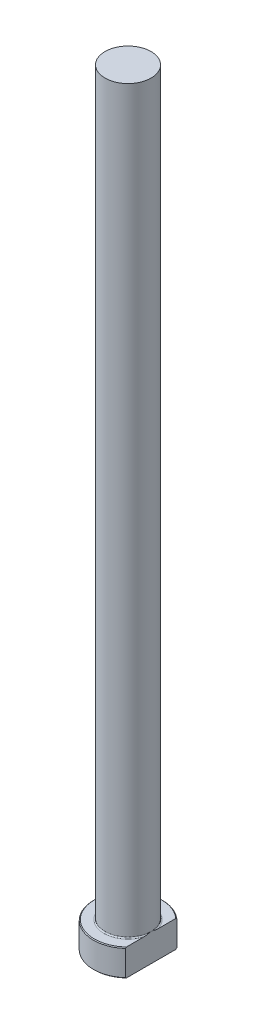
ISO-10303-21;
HEADER;
FILE_DESCRIPTION(('STEP AP214'),'2;1');
FILE_NAME('part.step','',(''),(''),'','','');
FILE_SCHEMA(('AUTOMOTIVE_DESIGN { 1 0 10303 214 1 1 1 1 }'));
ENDSEC;
DATA;
#1=APPLICATION_CONTEXT('core data for automotive mechanical design processes');
#2=APPLICATION_PROTOCOL_DEFINITION('international standard','automotive_design',2000,#1);
#3=PRODUCT_CONTEXT('',#1,'mechanical');
#4=PRODUCT('Part','Part','',(#3));
#5=PRODUCT_RELATED_PRODUCT_CATEGORY('part','',(#4));
#6=PRODUCT_DEFINITION_FORMATION('','',#4);
#7=PRODUCT_DEFINITION_CONTEXT('part definition',#1,'design');
#8=PRODUCT_DEFINITION('design','',#6,#7);
#9=PRODUCT_DEFINITION_SHAPE('','',#8);
#10=(LENGTH_UNIT() NAMED_UNIT(*) SI_UNIT(.MILLI.,.METRE.));
#11=(NAMED_UNIT(*) PLANE_ANGLE_UNIT() SI_UNIT($,.RADIAN.));
#12=(NAMED_UNIT(*) SI_UNIT($,.STERADIAN.) SOLID_ANGLE_UNIT());
#13=UNCERTAINTY_MEASURE_WITH_UNIT(LENGTH_MEASURE(1.E-05),#10,'distance_accuracy_value','');
#14=(GEOMETRIC_REPRESENTATION_CONTEXT(3) GLOBAL_UNCERTAINTY_ASSIGNED_CONTEXT((#13)) GLOBAL_UNIT_ASSIGNED_CONTEXT((#10,
#11,#12)) REPRESENTATION_CONTEXT('',''));
#15=CARTESIAN_POINT('',(0.,0.,0.));
#16=DIRECTION('',(0.,0.,1.));
#17=DIRECTION('',(1.,0.,0.));
#18=AXIS2_PLACEMENT_3D('',#15,#16,#17);
#19=CARTESIAN_POINT('',(0.,0.,0.));
#20=DIRECTION('',(0.,-1.,0.));
#21=DIRECTION('',(0.,0.,-1.));
#22=AXIS2_PLACEMENT_3D('',#19,#20,#21);
#23=PLANE('',#22);
#24=CARTESIAN_POINT('',(0.,0.,0.));
#25=DIRECTION('',(0.,-1.,0.));
#26=DIRECTION('',(0.,0.,-1.));
#27=AXIS2_PLACEMENT_3D('',#24,#25,#26);
#28=CIRCLE('',#27,8.79999999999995);
#29=CARTESIAN_POINT('',(5.99999999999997,0.,6.43739077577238));
#30=VERTEX_POINT('',#29);
#31=CARTESIAN_POINT('',(5.99999999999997,0.,-6.43739077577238));
#32=VERTEX_POINT('',#31);
#33=EDGE_CURVE('E98',#30,#32,#28,.T.);
#34=ORIENTED_EDGE('',*,*,#33,.T.);
#35=DIRECTION('',(0.,0.,1.));
#36=VECTOR('',#35,1.);
#37=CARTESIAN_POINT('',(5.99999999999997,0.,-6.70820393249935));
#38=LINE('',#37,#36);
#39=EDGE_CURVE('E83',#32,#30,#38,.T.);
#40=ORIENTED_EDGE('',*,*,#39,.T.);
#41=EDGE_LOOP('',(#34,#40));
#42=FACE_BOUND('',#41,.T.);
#43=ADVANCED_FACE('F32',(#42),#23,.T.);
#44=CARTESIAN_POINT('',(0.,259.958771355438,0.));
#45=DIRECTION('',(0.,1.,0.));
#46=DIRECTION('',(0.,0.,1.));
#47=AXIS2_PLACEMENT_3D('',#44,#45,#46);
#48=CYLINDRICAL_SURFACE('',#47,8.99999999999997);
#49=CARTESIAN_POINT('',(0.,6.80000000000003,0.));
#50=DIRECTION('',(0.,1.,0.));
#51=DIRECTION('',(0.,0.,1.));
#52=AXIS2_PLACEMENT_3D('',#49,#50,#51);
#53=CIRCLE('',#52,8.99999999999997);
#54=CARTESIAN_POINT('',(5.99999999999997,6.80000000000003,6.70820393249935));
#55=VERTEX_POINT('',#54);
#56=CARTESIAN_POINT('',(5.99999999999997,6.80000000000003,-6.70820393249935));
#57=VERTEX_POINT('',#56);
#58=EDGE_CURVE('E104',#55,#57,#53,.F.);
#59=ORIENTED_EDGE('',*,*,#58,.T.);
#60=DIRECTION('',(0.,-1.,0.));
#61=VECTOR('',#60,1.);
#62=CARTESIAN_POINT('',(5.99999999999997,200.,-6.70820393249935));
#63=LINE('',#62,#61);
#64=CARTESIAN_POINT('',(5.99999999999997,0.200000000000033,-6.70820393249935));
#65=VERTEX_POINT('',#64);
#66=EDGE_CURVE('E183',#57,#65,#63,.T.);
#67=ORIENTED_EDGE('',*,*,#66,.T.);
#68=CARTESIAN_POINT('',(0.,0.200000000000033,0.));
#69=DIRECTION('',(0.,-1.,0.));
#70=DIRECTION('',(0.,0.,-1.));
#71=AXIS2_PLACEMENT_3D('',#68,#69,#70);
#72=CIRCLE('',#71,8.99999999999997);
#73=CARTESIAN_POINT('',(5.99999999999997,0.200000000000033,6.70820393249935));
#74=VERTEX_POINT('',#73);
#75=EDGE_CURVE('E100',#65,#74,#72,.F.);
#76=ORIENTED_EDGE('',*,*,#75,.T.);
#77=DIRECTION('',(0.,-1.,0.));
#78=VECTOR('',#77,1.);
#79=CARTESIAN_POINT('',(5.99999999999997,200.,6.70820393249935));
#80=LINE('',#79,#78);
#81=EDGE_CURVE('E93',#55,#74,#80,.T.);
#82=ORIENTED_EDGE('',*,*,#81,.F.);
#83=EDGE_LOOP('',(#59,#67,#76,#82));
#84=FACE_BOUND('',#83,.T.);
#85=ADVANCED_FACE('F158',(#84),#48,.T.);
#86=CARTESIAN_POINT('',(-8.99999999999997,7.,0.));
#87=DIRECTION('',(0.,1.,0.));
#88=DIRECTION('',(0.,0.,1.));
#89=AXIS2_PLACEMENT_3D('',#86,#87,#88);
#90=PLANE('',#89);
#91=CARTESIAN_POINT('',(0.,7.,0.));
#92=DIRECTION('',(0.,1.,0.));
#93=DIRECTION('',(0.,0.,1.));
#94=AXIS2_PLACEMENT_3D('',#91,#92,#93);
#95=CIRCLE('',#94,8.79999999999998);
#96=CARTESIAN_POINT('',(5.99999999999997,7.,-6.43739077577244));
#97=VERTEX_POINT('',#96);
#98=CARTESIAN_POINT('',(5.99999999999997,7.,6.43739077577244));
#99=VERTEX_POINT('',#98);
#100=EDGE_CURVE('E178',#97,#99,#95,.T.);
#101=ORIENTED_EDGE('',*,*,#100,.T.);
#102=DIRECTION('',(0.,0.,-1.));
#103=VECTOR('',#102,1.);
#104=CARTESIAN_POINT('',(5.99999999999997,7.,0.));
#105=LINE('',#104,#103);
#106=CARTESIAN_POINT('',(5.99999999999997,6.99999999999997,1.92093727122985));
#107=VERTEX_POINT('',#106);
#108=EDGE_CURVE('E57',#99,#107,#105,.T.);
#109=ORIENTED_EDGE('',*,*,#108,.T.);
#110=CARTESIAN_POINT('',(0.,7.,0.));
#111=DIRECTION('',(0.,1.,0.));
#112=DIRECTION('',(0.,0.,1.));
#113=AXIS2_PLACEMENT_3D('',#110,#111,#112);
#114=CIRCLE('',#113,6.29999999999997);
#115=CARTESIAN_POINT('',(5.99999999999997,6.99999999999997,-1.92093727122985));
#116=VERTEX_POINT('',#115);
#117=EDGE_CURVE('E107',#107,#116,#114,.F.);
#118=ORIENTED_EDGE('',*,*,#117,.T.);
#119=EDGE_CURVE('E136',#116,#97,#105,.T.);
#120=ORIENTED_EDGE('',*,*,#119,.T.);
#121=EDGE_LOOP('',(#101,#109,#118,#120));
#122=FACE_BOUND('',#121,.T.);
#123=ADVANCED_FACE('F147',(#122),#90,.T.);
#124=CARTESIAN_POINT('',(0.,7.00000000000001,0.));
#125=DIRECTION('',(0.,-1.,0.));
#126=DIRECTION('',(0.,0.,-1.));
#127=AXIS2_PLACEMENT_3D('',#124,#125,#126);
#128=CONICAL_SURFACE('',#127,8.79999999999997,0.785398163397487);
#129=ORIENTED_EDGE('',*,*,#58,.F.);
#130=CARTESIAN_POINT('',(5.99999999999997,-0.132115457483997,14.7591430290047));
#131=CARTESIAN_POINT('',(5.99999999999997,0.0733919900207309,14.537299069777));
#132=CARTESIAN_POINT('',(5.99999999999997,0.278550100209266,14.3151315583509));
#133=CARTESIAN_POINT('',(5.99999999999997,0.688060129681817,13.8700519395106));
#134=CARTESIAN_POINT('',(5.99999999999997,0.892412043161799,13.647139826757));
#135=CARTESIAN_POINT('',(5.99999999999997,1.50418032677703,12.9770492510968));
#136=CARTESIAN_POINT('',(5.99999999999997,1.91022091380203,12.5286117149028));
#137=CARTESIAN_POINT('',(5.99999999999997,2.71980134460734,11.6246427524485));
#138=CARTESIAN_POINT('',(5.99999999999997,3.12331180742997,11.1690849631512));
#139=CARTESIAN_POINT('',(5.99999999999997,3.92341525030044,10.2520077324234));
#140=CARTESIAN_POINT('',(5.99999999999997,4.32000903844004,9.79048899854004));
#141=CARTESIAN_POINT('',(5.99999999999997,5.02478816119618,8.95241885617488));
#142=CARTESIAN_POINT('',(5.99999999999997,5.33476112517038,8.57737771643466));
#143=CARTESIAN_POINT('',(5.99999999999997,5.79310598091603,8.00939108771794));
#144=CARTESIAN_POINT('',(5.99999999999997,5.94480562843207,7.81913145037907));
#145=CARTESIAN_POINT('',(5.99999999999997,6.24553651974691,7.43651727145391));
#146=CARTESIAN_POINT('',(5.99999999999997,6.39456781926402,7.24416277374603));
#147=CARTESIAN_POINT('',(5.99999999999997,6.68925367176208,6.8572154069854));
#148=CARTESIAN_POINT('',(5.99999999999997,6.83491177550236,6.66262524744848));
#149=CARTESIAN_POINT('',(5.99999999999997,7.122307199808,6.27057707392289));
#150=CARTESIAN_POINT('',(5.99999999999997,7.2640447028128,6.0731191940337));
#151=CARTESIAN_POINT('',(5.99999999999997,7.54263362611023,5.67488713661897));
#152=CARTESIAN_POINT('',(5.99999999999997,7.67948689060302,5.47411425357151));
#153=CARTESIAN_POINT('',(5.99999999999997,7.94714213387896,5.06858845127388));
#154=CARTESIAN_POINT('',(5.99999999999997,8.07794479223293,4.86383598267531));
#155=CARTESIAN_POINT('',(5.99999999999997,8.32827993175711,4.45554322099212));
#156=CARTESIAN_POINT('',(5.99999999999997,8.44802771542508,4.25213564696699));
#157=CARTESIAN_POINT('',(5.99999999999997,8.67837972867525,3.84013730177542));
#158=CARTESIAN_POINT('',(5.99999999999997,8.78898293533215,3.63154595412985));
#159=CARTESIAN_POINT('',(5.99999999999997,8.99840984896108,3.20863811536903));
#160=CARTESIAN_POINT('',(5.99999999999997,9.09724073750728,2.9943252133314));
#161=CARTESIAN_POINT('',(5.99999999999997,9.27991776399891,2.55937061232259));
#162=CARTESIAN_POINT('',(5.99999999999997,9.36376811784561,2.33873071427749));
#163=CARTESIAN_POINT('',(5.99999999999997,9.49627737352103,1.9401229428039));
#164=CARTESIAN_POINT('',(5.99999999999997,9.54862178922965,1.76338731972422));
#165=CARTESIAN_POINT('',(5.99999999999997,9.63978035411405,1.40643307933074));
#166=CARTESIAN_POINT('',(5.99999999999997,9.67859618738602,1.22621489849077));
#167=CARTESIAN_POINT('',(5.99999999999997,9.74077317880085,0.863704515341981));
#168=CARTESIAN_POINT('',(5.99999999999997,9.76418479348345,0.681421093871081));
#169=CARTESIAN_POINT('',(5.99999999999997,9.79447814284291,0.315473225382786));
#170=CARTESIAN_POINT('',(5.99999999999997,9.80136083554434,0.131808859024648));
#171=CARTESIAN_POINT('',(5.99999999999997,9.79818788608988,-0.23588167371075));
#172=CARTESIAN_POINT('',(5.99999999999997,9.78808514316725,-0.419907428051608));
#173=CARTESIAN_POINT('',(5.99999999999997,9.75144464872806,-0.786302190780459));
#174=CARTESIAN_POINT('',(5.99999999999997,9.72490559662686,-0.968671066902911));
#175=CARTESIAN_POINT('',(5.99999999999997,9.65670736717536,-1.33110767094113));
#176=CARTESIAN_POINT('',(5.99999999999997,9.61500120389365,-1.51116642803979));
#177=CARTESIAN_POINT('',(5.99999999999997,9.51838325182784,-1.86766519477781));
#178=CARTESIAN_POINT('',(5.99999999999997,9.46347085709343,-2.04410503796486));
#179=CARTESIAN_POINT('',(5.99999999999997,9.3356365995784,-2.41270922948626));
#180=CARTESIAN_POINT('',(5.99999999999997,9.26138327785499,-2.60440790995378));
#181=CARTESIAN_POINT('',(5.99999999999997,9.10155310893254,-2.9830649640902));
#182=CARTESIAN_POINT('',(5.99999999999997,9.01597146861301,-3.17002129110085));
#183=CARTESIAN_POINT('',(5.99999999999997,8.83553473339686,-3.53975380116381));
#184=CARTESIAN_POINT('',(5.99999999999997,8.74066449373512,-3.72252253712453));
#185=CARTESIAN_POINT('',(5.99999999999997,8.54355472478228,-4.08398624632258));
#186=CARTESIAN_POINT('',(5.99999999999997,8.44131612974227,-4.26268173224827));
#187=CARTESIAN_POINT('',(5.99999999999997,8.2295396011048,-4.61872309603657));
#188=CARTESIAN_POINT('',(5.99999999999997,8.11992610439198,-4.79602381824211));
#189=CARTESIAN_POINT('',(5.99999999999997,7.89571048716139,-5.14743548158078));
#190=CARTESIAN_POINT('',(5.99999999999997,7.78110825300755,-5.32154634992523));
#191=CARTESIAN_POINT('',(5.99999999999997,7.54792782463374,-5.66682327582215));
#192=CARTESIAN_POINT('',(5.99999999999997,7.4293537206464,-5.83799210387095));
#193=CARTESIAN_POINT('',(5.99999999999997,7.18881616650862,-6.17793707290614));
#194=CARTESIAN_POINT('',(5.99999999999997,7.06685256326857,-6.34671310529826));
#195=CARTESIAN_POINT('',(5.99999999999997,6.80539778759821,-6.702167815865));
#196=CARTESIAN_POINT('',(5.99999999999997,6.66554966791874,-6.88858356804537));
#197=CARTESIAN_POINT('',(5.99999999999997,6.38292065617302,-7.2591813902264));
#198=CARTESIAN_POINT('',(5.99999999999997,6.24013967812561,-7.44336339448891));
#199=CARTESIAN_POINT('',(5.99999999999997,5.80812002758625,-7.99307414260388));
#200=CARTESIAN_POINT('',(5.99999999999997,5.51523002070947,-8.35573349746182));
#201=CARTESIAN_POINT('',(5.99999999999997,4.9222461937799,-9.07562940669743));
#202=CARTESIAN_POINT('',(5.99999999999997,4.62214609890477,-9.43286076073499));
#203=CARTESIAN_POINT('',(5.99999999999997,4.01677382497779,-10.1429201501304));
#204=CARTESIAN_POINT('',(5.99999999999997,3.71150152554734,-10.4957480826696));
#205=CARTESIAN_POINT('',(5.99999999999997,3.11456796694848,-11.1779164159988));
#206=CARTESIAN_POINT('',(5.99999999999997,2.82312451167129,-11.5074478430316));
#207=CARTESIAN_POINT('',(5.99999999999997,2.23747184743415,-12.164052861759));
#208=CARTESIAN_POINT('',(5.99999999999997,1.94326258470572,-12.491126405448));
#209=CARTESIAN_POINT('',(5.99999999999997,1.35320776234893,-13.1426363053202));
#210=CARTESIAN_POINT('',(5.99999999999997,1.05736649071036,-13.4670765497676));
#211=CARTESIAN_POINT('',(5.99999999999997,0.463882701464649,-14.1142803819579));
#212=CARTESIAN_POINT('',(5.99999999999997,0.166240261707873,-14.4370440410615));
#213=CARTESIAN_POINT('',(5.99999999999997,-0.132115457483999,-14.7591430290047));
#214=B_SPLINE_CURVE_WITH_KNOTS('',3,(#130,#131,#132,#133,#134,#135,#136,#137,#138,#139,#140,
#141,#142,#143,#144,#145,#146,#147,#148,#149,#150,#151,#152,#153,#154,#155,#156,#157,#158,#159,
#160,#161,#162,#163,#164,#165,#166,#167,#168,#169,#170,#171,#172,#173,#174,#175,#176,#177,#178,
#179,#180,#181,#182,#183,#184,#185,#186,#187,#188,#189,#190,#191,#192,#193,#194,#195,#196,#197,
#198,#199,#200,#201,#202,#203,#204,#205,#206,#207,#208,#209,#210,#211,#212,#213),.UNSPECIFIED.,
.F.,.F.,(4,2,2,2,2,2,2,2,2,2,2,2,2,2,2,2,2,2,2,2,2,2,2,2,2,2,2,2,2,2,2,2,2,2,2,2,2,2,2,2,2,4),
(0.,0.907210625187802,1.81442776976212,3.62925156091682,5.45490487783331,7.28034345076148,
8.73990838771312,9.46989218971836,10.1998607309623,10.9290223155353,11.6581499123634,
12.3869992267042,13.1157664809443,13.8236973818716,14.531707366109,15.2392832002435,
15.946659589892,16.4991819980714,17.0516356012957,17.6022705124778,18.152873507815,
18.7050058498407,19.2571818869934,19.811083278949,20.3650100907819,20.9812908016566,
21.5978331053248,22.2153979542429,22.8328846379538,23.4581285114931,24.0833866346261,
24.7080195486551,25.3326807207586,26.0317691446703,26.7308780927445,28.1292235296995,
29.5288334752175,30.928476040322,32.2482200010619,33.5679896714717,34.8851960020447,
36.2023458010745),.UNSPECIFIED.);
#215=EDGE_CURVE('E135',#55,#99,#214,.T.);
#216=ORIENTED_EDGE('',*,*,#215,.T.);
#217=ORIENTED_EDGE('',*,*,#100,.F.);
#218=EDGE_CURVE('E127',#97,#57,#214,.T.);
#219=ORIENTED_EDGE('',*,*,#218,.T.);
#220=EDGE_LOOP('',(#129,#216,#217,#219));
#221=FACE_BOUND('',#220,.T.);
#222=ADVANCED_FACE('F143',(#221),#128,.T.);
#223=CARTESIAN_POINT('',(0.,0.200000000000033,0.));
#224=DIRECTION('',(0.,1.,0.));
#225=DIRECTION('',(0.,0.,1.));
#226=AXIS2_PLACEMENT_3D('',#223,#224,#225);
#227=CONICAL_SURFACE('',#226,8.99999999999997,0.785398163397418);
#228=ORIENTED_EDGE('',*,*,#75,.F.);
#229=CARTESIAN_POINT('',(5.99999999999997,7.13211545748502,-14.7591430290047));
#230=CARTESIAN_POINT('',(5.99999999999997,6.92660800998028,-14.537299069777));
#231=CARTESIAN_POINT('',(5.99999999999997,6.72144989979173,-14.315131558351));
#232=CARTESIAN_POINT('',(5.99999999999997,6.31193987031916,-13.8700519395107));
#233=CARTESIAN_POINT('',(5.99999999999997,6.10758795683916,-13.6471398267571));
#234=CARTESIAN_POINT('',(5.99999999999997,5.4958196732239,-12.9770492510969));
#235=CARTESIAN_POINT('',(5.99999999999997,5.08977908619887,-12.5286117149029));
#236=CARTESIAN_POINT('',(5.99999999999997,4.28019865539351,-11.6246427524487));
#237=CARTESIAN_POINT('',(5.99999999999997,3.87668819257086,-11.1690849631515));
#238=CARTESIAN_POINT('',(5.99999999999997,3.07658474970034,-10.2520077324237));
#239=CARTESIAN_POINT('',(5.99999999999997,2.67999096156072,-9.79048899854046));
#240=CARTESIAN_POINT('',(5.99999999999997,1.97521183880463,-8.95241885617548));
#241=CARTESIAN_POINT('',(5.99999999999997,1.66523887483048,-8.5773777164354));
#242=CARTESIAN_POINT('',(5.99999999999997,1.20689401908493,-8.00939108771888));
#243=CARTESIAN_POINT('',(5.99999999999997,1.05519437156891,-7.81913145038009));
#244=CARTESIAN_POINT('',(5.99999999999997,0.754463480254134,-7.43651727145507));
#245=CARTESIAN_POINT('',(5.99999999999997,0.60543218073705,-7.24416277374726));
#246=CARTESIAN_POINT('',(5.99999999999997,0.310746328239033,-6.85721540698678));
#247=CARTESIAN_POINT('',(5.99999999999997,0.165088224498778,-6.66262524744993));
#248=CARTESIAN_POINT('',(5.99999999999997,-0.122307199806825,-6.2705770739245));
#249=CARTESIAN_POINT('',(5.99999999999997,-0.2640447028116,-6.07311919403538));
#250=CARTESIAN_POINT('',(5.99999999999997,-0.542633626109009,-5.67488713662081));
#251=CARTESIAN_POINT('',(5.99999999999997,-0.679486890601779,-5.47411425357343));
#252=CARTESIAN_POINT('',(5.99999999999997,-0.947142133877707,-5.06858845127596));
#253=CARTESIAN_POINT('',(5.99999999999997,-1.07794479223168,-4.86383598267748));
#254=CARTESIAN_POINT('',(5.99999999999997,-1.32827993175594,-4.45554322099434));
#255=CARTESIAN_POINT('',(5.99999999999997,-1.44802771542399,-4.25213564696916));
#256=CARTESIAN_POINT('',(5.99999999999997,-1.67837972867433,-3.8401373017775));
#257=CARTESIAN_POINT('',(5.99999999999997,-1.78898293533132,-3.63154595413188));
#258=CARTESIAN_POINT('',(5.99999999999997,-1.99840984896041,-3.20863811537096));
#259=CARTESIAN_POINT('',(5.99999999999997,-2.0972407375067,-2.99432521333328));
#260=CARTESIAN_POINT('',(5.99999999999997,-2.2799177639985,-2.55937061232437));
#261=CARTESIAN_POINT('',(5.99999999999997,-2.36376811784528,-2.33873071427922));
#262=CARTESIAN_POINT('',(5.99999999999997,-2.49627737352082,-1.94012294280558));
#263=CARTESIAN_POINT('',(5.99999999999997,-2.54862178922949,-1.76338731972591));
#264=CARTESIAN_POINT('',(5.99999999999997,-2.63978035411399,-1.40643307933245));
#265=CARTESIAN_POINT('',(5.99999999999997,-2.67859618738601,-1.22621489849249));
#266=CARTESIAN_POINT('',(5.99999999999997,-2.74077317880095,-0.863704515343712));
#267=CARTESIAN_POINT('',(5.99999999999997,-2.7641847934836,-0.681421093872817));
#268=CARTESIAN_POINT('',(5.99999999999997,-2.79447814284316,-0.315473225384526));
#269=CARTESIAN_POINT('',(5.99999999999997,-2.80136083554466,-0.131808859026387));
#270=CARTESIAN_POINT('',(5.99999999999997,-2.7981878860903,0.23588167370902));
#271=CARTESIAN_POINT('',(5.99999999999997,-2.78808514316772,0.419907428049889));
#272=CARTESIAN_POINT('',(5.99999999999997,-2.75144464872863,0.786302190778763));
#273=CARTESIAN_POINT('',(5.99999999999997,-2.72490559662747,0.968671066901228));
#274=CARTESIAN_POINT('',(5.99999999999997,-2.65670736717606,1.33110767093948));
#275=CARTESIAN_POINT('',(5.99999999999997,-2.61500120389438,1.51116642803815));
#276=CARTESIAN_POINT('',(5.99999999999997,-2.51838325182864,1.8676651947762));
#277=CARTESIAN_POINT('',(5.99999999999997,-2.46347085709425,2.04410503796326));
#278=CARTESIAN_POINT('',(5.99999999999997,-2.33563659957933,2.41270922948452));
#279=CARTESIAN_POINT('',(5.99999999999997,-2.26138327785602,2.60440790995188));
#280=CARTESIAN_POINT('',(5.99999999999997,-2.10155310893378,2.98306496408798));
#281=CARTESIAN_POINT('',(5.99999999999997,-2.01597146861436,3.17002129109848));
#282=CARTESIAN_POINT('',(5.99999999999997,-1.83553473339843,3.53975380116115));
#283=CARTESIAN_POINT('',(5.99999999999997,-1.74066449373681,3.72252253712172));
#284=CARTESIAN_POINT('',(5.99999999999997,-1.5435547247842,4.08398624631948));
#285=CARTESIAN_POINT('',(5.99999999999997,-1.44131612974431,4.26268173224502));
#286=CARTESIAN_POINT('',(5.99999999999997,-1.22953960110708,4.61872309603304));
#287=CARTESIAN_POINT('',(5.99999999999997,-1.11992610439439,4.79602381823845));
#288=CARTESIAN_POINT('',(5.99999999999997,-0.895710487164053,5.14743548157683));
#289=CARTESIAN_POINT('',(5.99999999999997,-0.781108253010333,5.32154634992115));
#290=CARTESIAN_POINT('',(5.99999999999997,-0.547927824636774,5.66682327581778));
#291=CARTESIAN_POINT('',(5.99999999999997,-0.429353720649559,5.83799210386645));
#292=CARTESIAN_POINT('',(5.99999999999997,-0.188816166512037,6.17793707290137));
#293=CARTESIAN_POINT('',(5.99999999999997,-0.0668525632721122,6.34671310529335));
#294=CARTESIAN_POINT('',(5.99999999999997,0.194602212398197,6.7021678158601));
#295=CARTESIAN_POINT('',(5.99999999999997,0.334450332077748,6.88858356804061));
#296=CARTESIAN_POINT('',(5.99999999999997,0.617079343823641,7.25918139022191));
#297=CARTESIAN_POINT('',(5.99999999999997,0.759860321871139,7.44336339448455));
#298=CARTESIAN_POINT('',(5.99999999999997,1.19187997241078,7.99307414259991));
#299=CARTESIAN_POINT('',(5.99999999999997,1.48476997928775,8.35573349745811));
#300=CARTESIAN_POINT('',(5.99999999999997,2.07775380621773,9.07562940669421));
#301=CARTESIAN_POINT('',(5.99999999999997,2.37785390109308,9.43286076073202));
#302=CARTESIAN_POINT('',(5.99999999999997,2.9832261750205,10.1429201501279));
#303=CARTESIAN_POINT('',(5.99999999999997,3.28849847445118,10.4957480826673));
#304=CARTESIAN_POINT('',(5.99999999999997,3.88543203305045,11.1779164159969));
#305=CARTESIAN_POINT('',(5.99999999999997,4.17687548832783,11.5074478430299));
#306=CARTESIAN_POINT('',(5.99999999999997,4.76252815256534,12.1640528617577));
#307=CARTESIAN_POINT('',(5.99999999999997,5.05673741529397,12.4911264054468));
#308=CARTESIAN_POINT('',(5.99999999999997,5.64679223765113,13.1426363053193));
#309=CARTESIAN_POINT('',(5.99999999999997,5.9426335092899,13.4670765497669));
#310=CARTESIAN_POINT('',(5.99999999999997,6.53611729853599,14.1142803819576));
#311=CARTESIAN_POINT('',(5.99999999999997,6.83375973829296,14.4370440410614));
#312=CARTESIAN_POINT('',(5.99999999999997,7.13211545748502,14.7591430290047));
#313=B_SPLINE_CURVE_WITH_KNOTS('',3,(#229,#230,#231,#232,#233,#234,#235,#236,#237,#238,#239,
#240,#241,#242,#243,#244,#245,#246,#247,#248,#249,#250,#251,#252,#253,#254,#255,#256,#257,#258,
#259,#260,#261,#262,#263,#264,#265,#266,#267,#268,#269,#270,#271,#272,#273,#274,#275,#276,#277,
#278,#279,#280,#281,#282,#283,#284,#285,#286,#287,#288,#289,#290,#291,#292,#293,#294,#295,#296,
#297,#298,#299,#300,#301,#302,#303,#304,#305,#306,#307,#308,#309,#310,#311,#312),.UNSPECIFIED.,
.F.,.F.,(4,2,2,2,2,2,2,2,2,2,2,2,2,2,2,2,2,2,2,2,2,2,2,2,2,2,2,2,2,2,2,2,2,2,2,2,2,2,2,2,2,4),
(0.,0.907210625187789,1.81442776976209,3.62925156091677,5.45490487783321,7.28034345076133,
8.73990838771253,9.46989218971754,10.1998607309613,10.9290223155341,11.6581499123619,
12.3869992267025,13.1157664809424,13.82369738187,14.5317073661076,15.2392832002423,
15.9466595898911,16.4991819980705,17.0516356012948,17.6022705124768,18.1528735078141,
18.7050058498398,19.2571818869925,19.8110832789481,20.365010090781,20.9812908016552,
21.5978331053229,22.2153979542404,22.8328846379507,23.4581285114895,24.083386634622,
24.7080195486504,25.3326807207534,26.0317691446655,26.7308780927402,28.1292235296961,
29.5288334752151,30.9284760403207,32.2482200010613,33.5679896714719,34.8851960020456,
36.2023458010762),.UNSPECIFIED.);
#314=EDGE_CURVE('E86',#65,#32,#313,.T.);
#315=ORIENTED_EDGE('',*,*,#314,.T.);
#316=ORIENTED_EDGE('',*,*,#33,.F.);
#317=EDGE_CURVE('E89',#30,#74,#313,.T.);
#318=ORIENTED_EDGE('',*,*,#317,.T.);
#319=EDGE_LOOP('',(#228,#315,#316,#318));
#320=FACE_BOUND('',#319,.T.);
#321=ADVANCED_FACE('F97',(#320),#227,.T.);
#322=CARTESIAN_POINT('',(0.,7.29999999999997,0.));
#323=DIRECTION('',(0.,1.,0.));
#324=DIRECTION('',(0.,0.,1.));
#325=AXIS2_PLACEMENT_3D('',#322,#323,#324);
#326=TOROIDAL_SURFACE('',#325,6.29999999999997,0.3);
#327=CARTESIAN_POINT('',(5.99999999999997,7.29999999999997,0.));
#328=CARTESIAN_POINT('',(5.99999999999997,7.30000062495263,1.34604287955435E-10));
#329=CARTESIAN_POINT('',(5.99999999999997,7.30000124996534,-2.85495107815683E-07));
#330=CARTESIAN_POINT('',(5.99999999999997,7.30000241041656,-1.04928090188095E-06));
#331=CARTESIAN_POINT('',(5.99999999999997,7.30000292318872,-1.54785170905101E-06));
#332=CARTESIAN_POINT('',(5.99999999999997,7.30000401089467,-2.74944383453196E-06));
#333=CARTESIAN_POINT('',(5.99999999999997,7.30000456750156,-3.47196539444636E-06));
#334=CARTESIAN_POINT('',(5.99999999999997,7.30000554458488,-4.95172582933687E-06));
#335=CARTESIAN_POINT('',(5.99999999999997,7.30000596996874,-5.70604365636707E-06));
#336=CARTESIAN_POINT('',(5.99999999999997,7.30000759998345,-8.69525109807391E-06));
#337=CARTESIAN_POINT('',(5.99999999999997,7.30000872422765,-1.0978182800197E-05));
#338=CARTESIAN_POINT('',(5.99999999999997,7.30001052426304,-1.54456346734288E-05));
#339=CARTESIAN_POINT('',(5.99999999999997,7.3000112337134,-1.76170762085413E-05));
#340=CARTESIAN_POINT('',(5.99999999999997,7.30001429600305,-2.69928123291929E-05));
#341=CARTESIAN_POINT('',(5.99999999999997,7.30001664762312,-3.42000265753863E-05));
#342=CARTESIAN_POINT('',(5.99999999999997,7.30002002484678,-4.76829001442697E-05));
#343=CARTESIAN_POINT('',(5.99999999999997,7.30002120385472,-5.39195609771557E-05));
#344=CARTESIAN_POINT('',(5.99999999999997,7.30002992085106,-0.000100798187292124));
#345=CARTESIAN_POINT('',(5.99999999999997,7.30003667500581,-0.00014152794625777));
#346=CARTESIAN_POINT('',(5.99999999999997,7.30006623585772,-0.000303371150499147));
#347=CARTESIAN_POINT('',(5.99999999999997,7.30009428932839,-0.000423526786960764));
#348=CARTESIAN_POINT('',(5.99999999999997,7.30020425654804,-0.000901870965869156));
#349=CARTESIAN_POINT('',(5.99999999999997,7.3002828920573,-0.00126055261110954));
#350=CARTESIAN_POINT('',(5.99999999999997,7.30059934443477,-0.0026940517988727));
#351=CARTESIAN_POINT('',(5.99999999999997,7.3008413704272,-0.0037682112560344));
#352=CARTESIAN_POINT('',(5.99999999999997,7.30185255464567,-0.0082672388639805));
#353=CARTESIAN_POINT('',(5.99999999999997,7.30261638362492,-0.0116929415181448));
#354=CARTESIAN_POINT('',(5.99999999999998,7.30945824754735,-0.0423635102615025));
#355=CARTESIAN_POINT('',(5.99999999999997,7.31555811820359,-0.0696050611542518));
#356=CARTESIAN_POINT('',(5.99999999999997,7.32747716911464,-0.122985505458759));
#357=CARTESIAN_POINT('',(5.99999999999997,7.33329766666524,-0.149124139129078));
#358=CARTESIAN_POINT('',(5.99999999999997,7.34565922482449,-0.204790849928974));
#359=CARTESIAN_POINT('',(5.99999999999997,7.352196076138,-0.234319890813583));
#360=CARTESIAN_POINT('',(5.99999999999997,7.36527652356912,-0.29372170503));
#361=CARTESIAN_POINT('',(5.99999999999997,7.37181938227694,-0.323594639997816));
#362=CARTESIAN_POINT('',(5.99999999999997,7.38741819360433,-0.395325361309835));
#363=CARTESIAN_POINT('',(5.99999999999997,7.39643140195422,-0.437192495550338));
#364=CARTESIAN_POINT('',(5.99999999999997,7.41397520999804,-0.519837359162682));
#365=CARTESIAN_POINT('',(5.99999999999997,7.4225122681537,-0.560613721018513));
#366=CARTESIAN_POINT('',(5.99999999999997,7.45005469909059,-0.694529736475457));
#367=CARTESIAN_POINT('',(5.99999999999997,7.46845270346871,-0.787796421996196));
#368=CARTESIAN_POINT('',(5.99999999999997,7.50309772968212,-0.975673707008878));
#369=CARTESIAN_POINT('',(5.99999999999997,7.51932210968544,-1.07028855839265));
#370=CARTESIAN_POINT('',(5.99999999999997,7.54979671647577,-1.26922112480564));
#371=CARTESIAN_POINT('',(5.99999999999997,7.56370439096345,-1.37359247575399));
#372=CARTESIAN_POINT('',(5.99999999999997,7.58567213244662,-1.58267692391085));
#373=CARTESIAN_POINT('',(5.99999999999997,7.59375049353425,-1.68738790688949));
#374=CARTESIAN_POINT('',(5.99999999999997,7.59943466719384,-1.8430899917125));
#375=CARTESIAN_POINT('',(5.99999999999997,7.60029184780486,-1.89396002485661));
#376=CARTESIAN_POINT('',(5.99999999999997,7.5995288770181,-1.99574511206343));
#377=CARTESIAN_POINT('',(5.99999999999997,7.59790613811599,-2.04666015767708));
#378=CARTESIAN_POINT('',(5.99999999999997,7.59158346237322,-2.14740525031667));
#379=CARTESIAN_POINT('',(5.99999999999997,7.58693864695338,-2.19723851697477));
#380=CARTESIAN_POINT('',(5.99999999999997,7.57369485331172,-2.29634018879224));
#381=CARTESIAN_POINT('',(5.99999999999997,7.56510170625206,-2.3456093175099));
#382=CARTESIAN_POINT('',(5.99999999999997,7.54513600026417,-2.43101613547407));
#383=CARTESIAN_POINT('',(5.99999999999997,7.53495732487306,-2.46741817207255));
#384=CARTESIAN_POINT('',(5.99999999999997,7.5163599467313,-2.52083307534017));
#385=CARTESIAN_POINT('',(5.99999999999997,7.50961541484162,-2.53842082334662));
#386=CARTESIAN_POINT('',(5.99999999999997,7.49476050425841,-2.57300282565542));
#387=CARTESIAN_POINT('',(5.99999999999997,7.48665036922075,-2.58999718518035));
#388=CARTESIAN_POINT('',(5.99999999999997,7.4656679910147,-2.62872971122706));
#389=CARTESIAN_POINT('',(5.99999999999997,7.45211281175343,-2.65012863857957));
#390=CARTESIAN_POINT('',(5.99999999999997,7.42848584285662,-2.67978235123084));
#391=CARTESIAN_POINT('',(5.99999999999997,7.42001211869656,-2.68929941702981));
#392=CARTESIAN_POINT('',(5.99999999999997,7.40175979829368,-2.70700164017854));
#393=CARTESIAN_POINT('',(5.99999999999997,7.39198420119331,-2.71518976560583));
#394=CARTESIAN_POINT('',(5.99999999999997,7.37475773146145,-2.7269570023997));
#395=CARTESIAN_POINT('',(5.99999999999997,7.36772137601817,-2.73113834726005));
#396=CARTESIAN_POINT('',(5.99999999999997,7.35309194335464,-2.73838811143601));
#397=CARTESIAN_POINT('',(5.99999999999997,7.34549938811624,-2.7414575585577));
#398=CARTESIAN_POINT('',(5.99999999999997,7.32979919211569,-2.74623687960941));
#399=CARTESIAN_POINT('',(5.99999999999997,7.32168697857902,-2.74793213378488));
#400=CARTESIAN_POINT('',(5.99999999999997,7.30528814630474,-2.74970225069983));
#401=CARTESIAN_POINT('',(5.99999999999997,7.29700168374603,-2.74977850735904));
#402=CARTESIAN_POINT('',(5.99999999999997,7.2816016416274,-2.74839814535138));
#403=CARTESIAN_POINT('',(5.99999999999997,7.27447007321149,-2.74713049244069));
#404=CARTESIAN_POINT('',(5.99999999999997,7.26050316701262,-2.74347158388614));
#405=CARTESIAN_POINT('',(5.99999999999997,7.25366802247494,-2.7410796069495));
#406=CARTESIAN_POINT('',(5.99999999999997,7.23783277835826,-2.73423902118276));
#407=CARTESIAN_POINT('',(5.99999999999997,7.22902314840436,-2.72935244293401));
#408=CARTESIAN_POINT('',(5.99999999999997,7.21228574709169,-2.7182516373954));
#409=CARTESIAN_POINT('',(5.99999999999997,7.20436026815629,-2.71203407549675));
#410=CARTESIAN_POINT('',(5.99999999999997,7.18433696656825,-2.69420240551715));
#411=CARTESIAN_POINT('',(5.99999999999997,7.17298706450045,-2.68175715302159));
#412=CARTESIAN_POINT('',(5.99999999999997,7.15219498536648,-2.65539556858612));
#413=CARTESIAN_POINT('',(5.99999999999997,7.14275658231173,-2.64147640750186));
#414=CARTESIAN_POINT('',(5.99999999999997,7.12508934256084,-2.61223187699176));
#415=CARTESIAN_POINT('',(5.99999999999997,7.11691464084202,-2.59687428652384));
#416=CARTESIAN_POINT('',(5.99999999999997,7.10186133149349,-2.56552911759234));
#417=CARTESIAN_POINT('',(5.99999999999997,7.09498416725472,-2.54954086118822));
#418=CARTESIAN_POINT('',(5.99999999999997,7.07586257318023,-2.50075322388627));
#419=CARTESIAN_POINT('',(5.99999999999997,7.06523495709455,-2.46732486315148));
#420=CARTESIAN_POINT('',(5.99999999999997,7.04175411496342,-2.38014114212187));
#421=CARTESIAN_POINT('',(5.99999999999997,7.0311656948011,-2.32580591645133));
#422=CARTESIAN_POINT('',(5.99999999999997,7.01502027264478,-2.21628778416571));
#423=CARTESIAN_POINT('',(5.99999999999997,7.00947977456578,-2.16110269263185));
#424=CARTESIAN_POINT('',(5.99999999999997,7.00227593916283,-2.05225433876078));
#425=CARTESIAN_POINT('',(5.99999999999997,7.00049528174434,-1.99859827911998));
#426=CARTESIAN_POINT('',(5.99999999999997,6.99968738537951,-1.89155586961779));
#427=CARTESIAN_POINT('',(5.99999999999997,7.00064591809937,-1.83816956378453));
#428=CARTESIAN_POINT('',(5.99999999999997,7.00516082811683,-1.72092619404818));
#429=CARTESIAN_POINT('',(5.99999999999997,7.0091939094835,-1.65708843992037));
#430=CARTESIAN_POINT('',(5.99999999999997,7.01973827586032,-1.52965474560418));
#431=CARTESIAN_POINT('',(5.99999999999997,7.02624848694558,-1.46605871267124));
#432=CARTESIAN_POINT('',(5.99999999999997,7.04143114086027,-1.33760082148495));
#433=CARTESIAN_POINT('',(5.99999999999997,7.05015116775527,-1.27274468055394));
#434=CARTESIAN_POINT('',(5.99999999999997,7.06927542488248,-1.14310871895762));
#435=CARTESIAN_POINT('',(5.99999999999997,7.07968406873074,-1.07832955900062));
#436=CARTESIAN_POINT('',(5.99999999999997,7.10594320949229,-0.924890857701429));
#437=CARTESIAN_POINT('',(5.99999999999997,7.12237584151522,-0.836331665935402));
#438=CARTESIAN_POINT('',(5.99999999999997,7.15676035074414,-0.660568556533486));
#439=CARTESIAN_POINT('',(5.99999999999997,7.17469265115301,-0.573360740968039));
#440=CARTESIAN_POINT('',(5.99999999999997,7.20946366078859,-0.409309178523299));
#441=CARTESIAN_POINT('',(5.99999999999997,7.22618667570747,-0.332440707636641));
#442=CARTESIAN_POINT('',(5.99999999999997,7.25202386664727,-0.215187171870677));
#443=CARTESIAN_POINT('',(5.99999999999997,7.26098977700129,-0.174768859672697));
#444=CARTESIAN_POINT('',(5.99999999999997,7.27885525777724,-0.0946083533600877));
#445=CARTESIAN_POINT('',(5.99999999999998,7.28775352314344,-0.0548658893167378));
#446=CARTESIAN_POINT('',(5.99999999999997,7.2973853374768,-0.0116849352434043));
#447=CARTESIAN_POINT('',(5.99999999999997,7.29815099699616,-0.0082512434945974));
#448=CARTESIAN_POINT('',(5.99999999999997,7.2991626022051,-0.00375043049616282));
#449=CARTESIAN_POINT('',(5.99999999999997,7.29940322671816,-0.00268247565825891));
#450=CARTESIAN_POINT('',(5.99999999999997,7.29971797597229,-0.0012566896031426));
#451=CARTESIAN_POINT('',(5.99999999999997,7.2997962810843,-0.000899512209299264));
#452=CARTESIAN_POINT('',(5.99999999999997,7.2999058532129,-0.000422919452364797));
#453=CARTESIAN_POINT('',(5.99999999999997,7.29993385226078,-0.000303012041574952));
#454=CARTESIAN_POINT('',(5.99999999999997,7.299963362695,-0.000141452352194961));
#455=CARTESIAN_POINT('',(5.99999999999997,7.29997011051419,-0.000100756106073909));
#456=CARTESIAN_POINT('',(5.99999999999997,7.29997881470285,-5.39118915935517E-05));
#457=CARTESIAN_POINT('',(5.99999999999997,7.29997999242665,-4.76769647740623E-05));
#458=CARTESIAN_POINT('',(5.99999999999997,7.29998336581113,-3.41977669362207E-05));
#459=CARTESIAN_POINT('',(5.99999999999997,7.29998571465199,-2.69924043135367E-05));
#460=CARTESIAN_POINT('',(5.99999999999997,7.29998877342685,-1.76186229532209E-05));
#461=CARTESIAN_POINT('',(5.99999999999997,7.29998948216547,-1.54473107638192E-05));
#462=CARTESIAN_POINT('',(5.99999999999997,7.29999128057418,-1.09800124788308E-05));
#463=CARTESIAN_POINT('',(5.99999999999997,7.29999240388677,-8.69708706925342E-06));
#464=CARTESIAN_POINT('',(5.99999999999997,7.29999403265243,-5.70776681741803E-06));
#465=CARTESIAN_POINT('',(5.99999999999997,7.29999445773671,-4.95337952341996E-06));
#466=CARTESIAN_POINT('',(5.99999999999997,7.29999543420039,-3.47342608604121E-06));
#467=CARTESIAN_POINT('',(5.99999999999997,7.29999599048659,-2.7507782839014E-06));
#468=CARTESIAN_POINT('',(5.99999999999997,7.29999707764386,-1.54889527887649E-06));
#469=CARTESIAN_POINT('',(5.99999999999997,7.29999759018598,-1.0501721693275E-06));
#470=CARTESIAN_POINT('',(5.99999999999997,7.29999875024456,-2.85992424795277E-07));
#471=CARTESIAN_POINT('',(5.99999999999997,7.29999937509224,-1.34594612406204E-10));
#472=CARTESIAN_POINT('',(5.99999999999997,7.29999999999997,0.));
#473=B_SPLINE_CURVE_WITH_KNOTS('',3,(#327,#328,#329,#330,#331,#332,#333,#334,#335,#336,#337,
#338,#339,#340,#341,#342,#343,#344,#345,#346,#347,#348,#349,#350,#351,#352,#353,#354,#355,#356,
#357,#358,#359,#360,#361,#362,#363,#364,#365,#366,#367,#368,#369,#370,#371,#372,#373,#374,#375,
#376,#377,#378,#379,#380,#381,#382,#383,#384,#385,#386,#387,#388,#389,#390,#391,#392,#393,#394,
#395,#396,#397,#398,#399,#400,#401,#402,#403,#404,#405,#406,#407,#408,#409,#410,#411,#412,#413,
#414,#415,#416,#417,#418,#419,#420,#421,#422,#423,#424,#425,#426,#427,#428,#429,#430,#431,#432,
#433,#434,#435,#436,#437,#438,#439,#440,#441,#442,#443,#444,#445,#446,#447,#448,#449,#450,#451,
#452,#453,#454,#455,#456,#457,#458,#459,#460,#461,#462,#463,#464,#465,#466,#467,#468,#469,#470,
#471,#472),.UNSPECIFIED.,.T.,.F.,(4,2,2,2,2,2,2,2,2,2,2,2,2,2,2,2,2,2,2,2,2,2,2,2,2,2,2,2,2,2,2,
2,2,2,2,2,2,2,2,2,2,2,2,2,2,2,2,2,2,2,2,2,2,2,2,2,2,2,2,2,2,2,2,2,2,2,2,2,2,2,2,2,4),(0.,
1.90630853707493E-06,4.0638928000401E-06,6.78060422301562E-06,9.37792731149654E-06,
1.69875448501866E-05,2.38342815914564E-05,4.65460519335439E-05,6.55661832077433E-05,
0.000189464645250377,0.000559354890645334,0.001661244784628,0.00496415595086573,
0.0154940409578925,0.0992404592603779,0.179577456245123,0.270309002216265,0.362052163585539,
0.490530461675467,0.615511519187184,0.900684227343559,1.1886283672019,1.50441328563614,
1.8192028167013,1.97178950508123,2.1245355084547,2.27457076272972,2.4243851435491,
2.53755667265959,2.59401506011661,2.65046338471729,2.72600079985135,2.76413970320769,
2.80219221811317,2.82667181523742,2.85112872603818,2.8758425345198,2.90053506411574,
2.92216471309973,2.94380825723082,2.97385970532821,3.00398734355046,3.05423323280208,
3.10457737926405,3.15668997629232,3.20886020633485,3.31385890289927,3.47955406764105,
3.64578904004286,3.80675522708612,3.96688682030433,4.15871791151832,4.35046593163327,
4.54675795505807,4.74357155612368,5.01375693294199,5.2808448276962,5.51684158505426,
5.64104475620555,5.76322108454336,5.77377554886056,5.77705938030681,5.77815664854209,
5.77852577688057,5.77864957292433,5.77866858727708,5.77869129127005,5.77869813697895,
5.77870574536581,5.77870834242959,5.77871105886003,5.77871321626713,5.77871512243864),.UNSPECIFIED.);
#474=CARTESIAN_POINT('',(5.99999999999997,7.29999999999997,0.));
#475=VERTEX_POINT('',#474);
#476=EDGE_CURVE('E11',#116,#475,#473,.T.);
#477=ORIENTED_EDGE('',*,*,#476,.F.);
#478=ORIENTED_EDGE('',*,*,#117,.F.);
#479=CARTESIAN_POINT('',(5.99999999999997,7.29999999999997,0.));
#480=CARTESIAN_POINT('',(5.99999999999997,7.29999937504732,-1.34604253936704E-10));
#481=CARTESIAN_POINT('',(5.99999999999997,7.29999875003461,2.85495107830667E-07));
#482=CARTESIAN_POINT('',(5.99999999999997,7.29999758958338,1.04928090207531E-06));
#483=CARTESIAN_POINT('',(5.99999999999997,7.29999707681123,1.54785170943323E-06));
#484=CARTESIAN_POINT('',(5.99999999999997,7.29999598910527,2.74944383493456E-06));
#485=CARTESIAN_POINT('',(5.99999999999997,7.29999543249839,3.47196539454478E-06));
#486=CARTESIAN_POINT('',(5.99999999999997,7.29999445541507,4.95172582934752E-06));
#487=CARTESIAN_POINT('',(5.99999999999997,7.29999403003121,5.70604365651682E-06));
#488=CARTESIAN_POINT('',(5.99999999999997,7.2999924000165,8.69525109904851E-06));
#489=CARTESIAN_POINT('',(5.99999999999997,7.2999912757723,1.09781828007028E-05));
#490=CARTESIAN_POINT('',(5.99999999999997,7.29998947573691,1.54456346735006E-05));
#491=CARTESIAN_POINT('',(5.99999999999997,7.29998876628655,1.76170762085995E-05));
#492=CARTESIAN_POINT('',(5.99999999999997,7.2999857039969,2.69928123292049E-05));
#493=CARTESIAN_POINT('',(5.99999999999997,7.29998335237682,3.42000265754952E-05));
#494=CARTESIAN_POINT('',(5.99999999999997,7.29997997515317,4.76829001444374E-05));
#495=CARTESIAN_POINT('',(5.99999999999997,7.29997879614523,5.39195609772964E-05));
#496=CARTESIAN_POINT('',(5.99999999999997,7.29997007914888,0.000100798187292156));
#497=CARTESIAN_POINT('',(5.99999999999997,7.29996332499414,0.000141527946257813));
#498=CARTESIAN_POINT('',(5.99999999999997,7.29993376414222,0.000303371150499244));
#499=CARTESIAN_POINT('',(5.99999999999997,7.29990571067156,0.00042352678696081));
#500=CARTESIAN_POINT('',(5.99999999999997,7.29979574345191,0.00090187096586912));
#501=CARTESIAN_POINT('',(5.99999999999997,7.29971710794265,0.00126055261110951));
#502=CARTESIAN_POINT('',(5.99999999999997,7.29940065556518,0.0026940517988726));
#503=CARTESIAN_POINT('',(5.99999999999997,7.29915862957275,0.00376821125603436));
#504=CARTESIAN_POINT('',(5.99999999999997,7.29814744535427,0.00826723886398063));
#505=CARTESIAN_POINT('',(5.99999999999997,7.29738361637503,0.0116929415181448));
#506=CARTESIAN_POINT('',(5.99999999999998,7.2905417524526,0.0423635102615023));
#507=CARTESIAN_POINT('',(5.99999999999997,7.28444188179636,0.0696050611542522));
#508=CARTESIAN_POINT('',(5.99999999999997,7.2725228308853,0.12298550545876));
#509=CARTESIAN_POINT('',(5.99999999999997,7.26670233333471,0.149124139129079));
#510=CARTESIAN_POINT('',(5.99999999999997,7.25434077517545,0.204790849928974));
#511=CARTESIAN_POINT('',(5.99999999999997,7.24780392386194,0.234319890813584));
#512=CARTESIAN_POINT('',(5.99999999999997,7.23472347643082,0.29372170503));
#513=CARTESIAN_POINT('',(5.99999999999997,7.228180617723,0.323594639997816));
#514=CARTESIAN_POINT('',(5.99999999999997,7.21258180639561,0.395325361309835));
#515=CARTESIAN_POINT('',(5.99999999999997,7.20356859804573,0.437192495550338));
#516=CARTESIAN_POINT('',(5.99999999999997,7.18602479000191,0.519837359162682));
#517=CARTESIAN_POINT('',(5.99999999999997,7.17748773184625,0.560613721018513));
#518=CARTESIAN_POINT('',(5.99999999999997,7.14994530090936,0.694529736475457));
#519=CARTESIAN_POINT('',(5.99999999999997,7.13154729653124,0.787796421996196));
#520=CARTESIAN_POINT('',(5.99999999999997,7.09690227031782,0.975673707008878));
#521=CARTESIAN_POINT('',(5.99999999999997,7.08067789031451,1.07028855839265));
#522=CARTESIAN_POINT('',(5.99999999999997,7.05020328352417,1.26922112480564));
#523=CARTESIAN_POINT('',(5.99999999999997,7.0362956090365,1.37359247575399));
#524=CARTESIAN_POINT('',(5.99999999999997,7.01432786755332,1.58267692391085));
#525=CARTESIAN_POINT('',(5.99999999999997,7.0062495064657,1.68738790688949));
#526=CARTESIAN_POINT('',(5.99999999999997,7.00056533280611,1.8430899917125));
#527=CARTESIAN_POINT('',(5.99999999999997,6.99970815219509,1.89396002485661));
#528=CARTESIAN_POINT('',(5.99999999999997,7.00047112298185,1.99574511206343));
#529=CARTESIAN_POINT('',(5.99999999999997,7.00209386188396,2.04666015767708));
#530=CARTESIAN_POINT('',(5.99999999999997,7.00841653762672,2.14740525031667));
#531=CARTESIAN_POINT('',(5.99999999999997,7.01306135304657,2.19723851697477));
#532=CARTESIAN_POINT('',(5.99999999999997,7.02630514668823,2.29634018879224));
#533=CARTESIAN_POINT('',(5.99999999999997,7.03489829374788,2.3456093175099));
#534=CARTESIAN_POINT('',(5.99999999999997,7.05486399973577,2.43101613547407));
#535=CARTESIAN_POINT('',(5.99999999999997,7.06504267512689,2.46741817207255));
#536=CARTESIAN_POINT('',(5.99999999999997,7.08364005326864,2.52083307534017));
#537=CARTESIAN_POINT('',(5.99999999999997,7.09038458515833,2.53842082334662));
#538=CARTESIAN_POINT('',(5.99999999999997,7.10523949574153,2.57300282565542));
#539=CARTESIAN_POINT('',(5.99999999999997,7.1133496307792,2.58999718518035));
#540=CARTESIAN_POINT('',(5.99999999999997,7.13433200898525,2.62872971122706));
#541=CARTESIAN_POINT('',(5.99999999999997,7.14788718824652,2.65012863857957));
#542=CARTESIAN_POINT('',(5.99999999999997,7.17151415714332,2.67978235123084));
#543=CARTESIAN_POINT('',(5.99999999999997,7.17998788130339,2.68929941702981));
#544=CARTESIAN_POINT('',(5.99999999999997,7.19824020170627,2.70700164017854));
#545=CARTESIAN_POINT('',(5.99999999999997,7.20801579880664,2.71518976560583));
#546=CARTESIAN_POINT('',(5.99999999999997,7.2252422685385,2.7269570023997));
#547=CARTESIAN_POINT('',(5.99999999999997,7.23227862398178,2.73113834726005));
#548=CARTESIAN_POINT('',(5.99999999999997,7.24690805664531,2.73838811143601));
#549=CARTESIAN_POINT('',(5.99999999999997,7.2545006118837,2.7414575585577));
#550=CARTESIAN_POINT('',(5.99999999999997,7.27020080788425,2.74623687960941));
#551=CARTESIAN_POINT('',(5.99999999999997,7.27831302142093,2.74793213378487));
#552=CARTESIAN_POINT('',(5.99999999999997,7.29471185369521,2.74970225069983));
#553=CARTESIAN_POINT('',(5.99999999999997,7.30299831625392,2.74977850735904));
#554=CARTESIAN_POINT('',(5.99999999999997,7.31839835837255,2.74839814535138));
#555=CARTESIAN_POINT('',(5.99999999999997,7.32552992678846,2.74713049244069));
#556=CARTESIAN_POINT('',(5.99999999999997,7.33949683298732,2.74347158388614));
#557=CARTESIAN_POINT('',(5.99999999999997,7.34633197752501,2.7410796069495));
#558=CARTESIAN_POINT('',(5.99999999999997,7.36216722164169,2.73423902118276));
#559=CARTESIAN_POINT('',(5.99999999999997,7.37097685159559,2.72935244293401));
#560=CARTESIAN_POINT('',(5.99999999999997,7.38771425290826,2.7182516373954));
#561=CARTESIAN_POINT('',(5.99999999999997,7.39563973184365,2.71203407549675));
#562=CARTESIAN_POINT('',(5.99999999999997,7.4156630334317,2.69420240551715));
#563=CARTESIAN_POINT('',(5.99999999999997,7.42701293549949,2.68175715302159));
#564=CARTESIAN_POINT('',(5.99999999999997,7.44780501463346,2.65539556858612));
#565=CARTESIAN_POINT('',(5.99999999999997,7.45724341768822,2.64147640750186));
#566=CARTESIAN_POINT('',(5.99999999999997,7.4749106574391,2.61223187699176));
#567=CARTESIAN_POINT('',(5.99999999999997,7.48308535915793,2.59687428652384));
#568=CARTESIAN_POINT('',(5.99999999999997,7.49813866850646,2.56552911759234));
#569=CARTESIAN_POINT('',(5.99999999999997,7.50501583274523,2.54954086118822));
#570=CARTESIAN_POINT('',(5.99999999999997,7.52413742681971,2.50075322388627));
#571=CARTESIAN_POINT('',(5.99999999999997,7.5347650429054,2.46732486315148));
#572=CARTESIAN_POINT('',(5.99999999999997,7.55824588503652,2.38014114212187));
#573=CARTESIAN_POINT('',(5.99999999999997,7.56883430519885,2.32580591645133));
#574=CARTESIAN_POINT('',(5.99999999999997,7.58497972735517,2.21628778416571));
#575=CARTESIAN_POINT('',(5.99999999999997,7.59052022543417,2.16110269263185));
#576=CARTESIAN_POINT('',(5.99999999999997,7.59772406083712,2.05225433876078));
#577=CARTESIAN_POINT('',(5.99999999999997,7.5995047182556,1.99859827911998));
#578=CARTESIAN_POINT('',(5.99999999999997,7.60031261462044,1.89155586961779));
#579=CARTESIAN_POINT('',(5.99999999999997,7.59935408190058,1.83816956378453));
#580=CARTESIAN_POINT('',(5.99999999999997,7.59483917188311,1.72092619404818));
#581=CARTESIAN_POINT('',(5.99999999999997,7.59080609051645,1.65708843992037));
#582=CARTESIAN_POINT('',(5.99999999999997,7.58026172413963,1.52965474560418));
#583=CARTESIAN_POINT('',(5.99999999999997,7.57375151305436,1.46605871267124));
#584=CARTESIAN_POINT('',(5.99999999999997,7.55856885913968,1.33760082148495));
#585=CARTESIAN_POINT('',(5.99999999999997,7.54984883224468,1.27274468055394));
#586=CARTESIAN_POINT('',(5.99999999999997,7.53072457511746,1.14310871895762));
#587=CARTESIAN_POINT('',(5.99999999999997,7.5203159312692,1.07832955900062));
#588=CARTESIAN_POINT('',(5.99999999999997,7.49405679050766,0.924890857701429));
#589=CARTESIAN_POINT('',(5.99999999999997,7.47762415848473,0.836331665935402));
#590=CARTESIAN_POINT('',(5.99999999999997,7.44323964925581,0.660568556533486));
#591=CARTESIAN_POINT('',(5.99999999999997,7.42530734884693,0.57336074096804));
#592=CARTESIAN_POINT('',(5.99999999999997,7.39053633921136,0.409309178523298));
#593=CARTESIAN_POINT('',(5.99999999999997,7.37381332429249,0.332440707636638));
#594=CARTESIAN_POINT('',(5.99999999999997,7.34797613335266,0.215187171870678));
#595=CARTESIAN_POINT('',(5.99999999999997,7.33901022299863,0.174768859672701));
#596=CARTESIAN_POINT('',(5.99999999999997,7.32114474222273,0.094608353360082));
#597=CARTESIAN_POINT('',(5.99999999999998,7.31224647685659,0.0548658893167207));
#598=CARTESIAN_POINT('',(5.99999999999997,7.30261466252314,0.0116849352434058));
#599=CARTESIAN_POINT('',(5.99999999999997,7.30184900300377,0.00825124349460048));
#600=CARTESIAN_POINT('',(5.99999999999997,7.30083739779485,0.00375043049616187));
#601=CARTESIAN_POINT('',(5.99999999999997,7.30059677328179,0.00268247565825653));
#602=CARTESIAN_POINT('',(5.99999999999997,7.30028202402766,0.00125668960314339));
#603=CARTESIAN_POINT('',(5.99999999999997,7.30020371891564,0.000899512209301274));
#604=CARTESIAN_POINT('',(5.99999999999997,7.30009414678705,0.000422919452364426));
#605=CARTESIAN_POINT('',(5.99999999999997,7.30006614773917,0.000303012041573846));
#606=CARTESIAN_POINT('',(5.99999999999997,7.30003663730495,0.000141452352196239));
#607=CARTESIAN_POINT('',(5.99999999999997,7.30002988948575,0.000100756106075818));
#608=CARTESIAN_POINT('',(5.99999999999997,7.3000211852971,5.39118915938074E-05));
#609=CARTESIAN_POINT('',(5.99999999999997,7.3000200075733,4.76769647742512E-05));
#610=CARTESIAN_POINT('',(5.99999999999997,7.30001663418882,3.41977669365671E-05));
#611=CARTESIAN_POINT('',(5.99999999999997,7.30001428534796,2.69924043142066E-05));
#612=CARTESIAN_POINT('',(5.99999999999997,7.3000112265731,1.76186229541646E-05));
#613=CARTESIAN_POINT('',(5.99999999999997,7.30001051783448,1.54473107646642E-05));
#614=CARTESIAN_POINT('',(5.99999999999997,7.30000871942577,1.09800124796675E-05));
#615=CARTESIAN_POINT('',(5.99999999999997,7.30000759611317,8.69708707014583E-06));
#616=CARTESIAN_POINT('',(5.99999999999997,7.30000596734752,5.70776681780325E-06));
#617=CARTESIAN_POINT('',(5.99999999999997,7.30000554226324,4.95337952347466E-06));
#618=CARTESIAN_POINT('',(5.99999999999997,7.30000456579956,3.47342608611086E-06));
#619=CARTESIAN_POINT('',(5.99999999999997,7.30000400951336,2.75077828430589E-06));
#620=CARTESIAN_POINT('',(5.99999999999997,7.30000292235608,1.54889527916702E-06));
#621=CARTESIAN_POINT('',(5.99999999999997,7.30000240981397,1.05017216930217E-06));
#622=CARTESIAN_POINT('',(5.99999999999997,7.30000124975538,2.85992424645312E-07));
#623=CARTESIAN_POINT('',(5.99999999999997,7.3000006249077,1.34594578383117E-10));
#624=CARTESIAN_POINT('',(5.99999999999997,7.29999999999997,0.));
#625=B_SPLINE_CURVE_WITH_KNOTS('',3,(#479,#480,#481,#482,#483,#484,#485,#486,#487,#488,#489,
#490,#491,#492,#493,#494,#495,#496,#497,#498,#499,#500,#501,#502,#503,#504,#505,#506,#507,#508,
#509,#510,#511,#512,#513,#514,#515,#516,#517,#518,#519,#520,#521,#522,#523,#524,#525,#526,#527,
#528,#529,#530,#531,#532,#533,#534,#535,#536,#537,#538,#539,#540,#541,#542,#543,#544,#545,#546,
#547,#548,#549,#550,#551,#552,#553,#554,#555,#556,#557,#558,#559,#560,#561,#562,#563,#564,#565,
#566,#567,#568,#569,#570,#571,#572,#573,#574,#575,#576,#577,#578,#579,#580,#581,#582,#583,#584,
#585,#586,#587,#588,#589,#590,#591,#592,#593,#594,#595,#596,#597,#598,#599,#600,#601,#602,#603,
#604,#605,#606,#607,#608,#609,#610,#611,#612,#613,#614,#615,#616,#617,#618,#619,#620,#621,#622,
#623,#624),.UNSPECIFIED.,.T.,.F.,(4,2,2,2,2,2,2,2,2,2,2,2,2,2,2,2,2,2,2,2,2,2,2,2,2,2,2,2,2,2,2,
2,2,2,2,2,2,2,2,2,2,2,2,2,2,2,2,2,2,2,2,2,2,2,2,2,2,2,2,2,2,2,2,2,2,2,2,2,2,2,2,2,4),(0.,
1.90630853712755E-06,4.06389279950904E-06,6.78060422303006E-06,9.3779273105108E-06,
1.6987544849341E-05,2.38342815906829E-05,4.65460519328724E-05,6.55661832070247E-05,
0.000189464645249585,0.000559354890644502,0.00166124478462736,0.00496415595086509,
0.0154940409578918,0.099240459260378,0.179577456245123,0.270309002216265,0.362052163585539,
0.490530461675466,0.615511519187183,0.900684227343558,1.1886283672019,1.50441328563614,
1.8192028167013,1.97178950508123,2.1245355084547,2.27457076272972,2.4243851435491,
2.53755667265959,2.59401506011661,2.65046338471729,2.72600079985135,2.76413970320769,
2.80219221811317,2.82667181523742,2.85112872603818,2.8758425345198,2.90053506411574,
2.92216471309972,2.94380825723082,2.97385970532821,3.00398734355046,3.05423323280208,
3.10457737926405,3.15668997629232,3.20886020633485,3.31385890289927,3.47955406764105,
3.64578904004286,3.80675522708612,3.96688682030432,4.15871791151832,4.35046593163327,
4.54675795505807,4.74357155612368,5.01375693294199,5.2808448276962,5.51684158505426,
5.64104475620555,5.76322108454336,5.77377554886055,5.77705938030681,5.77815664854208,
5.77852577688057,5.77864957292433,5.77866858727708,5.77869129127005,5.77869813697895,
5.77870574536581,5.77870834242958,5.77871105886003,5.77871321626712,5.77871512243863),.UNSPECIFIED.);
#626=EDGE_CURVE('E46',#475,#107,#625,.T.);
#627=ORIENTED_EDGE('',*,*,#626,.F.);
#628=CARTESIAN_POINT('',(0.,7.29999999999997,0.));
#629=DIRECTION('',(0.,1.,0.));
#630=DIRECTION('',(0.,0.,1.));
#631=AXIS2_PLACEMENT_3D('',#628,#629,#630);
#632=CIRCLE('',#631,5.99999999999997);
#633=EDGE_CURVE('E103',#475,#475,#632,.T.);
#634=ORIENTED_EDGE('',*,*,#633,.F.);
#635=EDGE_LOOP('',(#477,#478,#627,#634));
#636=FACE_BOUND('',#635,.T.);
#637=ADVANCED_FACE('F34',(#636),#326,.F.);
#638=CARTESIAN_POINT('',(0.,259.958771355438,0.));
#639=DIRECTION('',(0.,1.,0.));
#640=DIRECTION('',(0.,0.,1.));
#641=AXIS2_PLACEMENT_3D('',#638,#639,#640);
#642=CYLINDRICAL_SURFACE('',#641,5.99999999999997);
#643=ORIENTED_EDGE('',*,*,#633,.T.);
#644=EDGE_LOOP('',(#643));
#645=FACE_BOUND('',#644,.T.);
#646=CARTESIAN_POINT('',(0.,200.,0.));
#647=DIRECTION('',(0.,1.,0.));
#648=DIRECTION('',(0.,0.,1.));
#649=AXIS2_PLACEMENT_3D('',#646,#647,#648);
#650=CIRCLE('',#649,5.99999999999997);
#651=CARTESIAN_POINT('',(0.,200.,5.99999999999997));
#652=VERTEX_POINT('',#651);
#653=EDGE_CURVE('E101',#652,#652,#650,.T.);
#654=ORIENTED_EDGE('',*,*,#653,.F.);
#655=EDGE_LOOP('',(#654));
#656=FACE_BOUND('',#655,.T.);
#657=ADVANCED_FACE('F155',(#645,#656),#642,.T.);
#658=CARTESIAN_POINT('',(-5.99999999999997,200.,0.));
#659=DIRECTION('',(0.,1.,0.));
#660=DIRECTION('',(0.,0.,1.));
#661=AXIS2_PLACEMENT_3D('',#658,#659,#660);
#662=PLANE('',#661);
#663=ORIENTED_EDGE('',*,*,#653,.T.);
#664=EDGE_LOOP('',(#663));
#665=FACE_BOUND('',#664,.T.);
#666=ADVANCED_FACE('F121',(#665),#662,.T.);
#667=CARTESIAN_POINT('',(5.99999999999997,200.,-6.70820393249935));
#668=DIRECTION('',(1.,0.,0.));
#669=DIRECTION('',(0.,0.,-1.));
#670=AXIS2_PLACEMENT_3D('',#667,#668,#669);
#671=PLANE('',#670);
#672=ORIENTED_EDGE('',*,*,#66,.F.);
#673=ORIENTED_EDGE('',*,*,#218,.F.);
#674=ORIENTED_EDGE('',*,*,#119,.F.);
#675=ORIENTED_EDGE('',*,*,#476,.T.);
#676=ORIENTED_EDGE('',*,*,#626,.T.);
#677=ORIENTED_EDGE('',*,*,#108,.F.);
#678=ORIENTED_EDGE('',*,*,#215,.F.);
#679=ORIENTED_EDGE('',*,*,#81,.T.);
#680=ORIENTED_EDGE('',*,*,#317,.F.);
#681=ORIENTED_EDGE('',*,*,#39,.F.);
#682=ORIENTED_EDGE('',*,*,#314,.F.);
#683=EDGE_LOOP('',(#672,#673,#674,#675,#676,#677,#678,#679,#680,#681,#682));
#684=FACE_BOUND('',#683,.T.);
#685=ADVANCED_FACE('F85',(#684),#671,.T.);
#686=CLOSED_SHELL('',(#43,#85,#123,#222,#321,#637,#657,#666,#685));
#687=MANIFOLD_SOLID_BREP('B2',#686);
#688=ADVANCED_BREP_SHAPE_REPRESENTATION('',(#18,#687),#14);
#689=SHAPE_DEFINITION_REPRESENTATION(#9,#688);
ENDSEC;
END-ISO-10303-21;
